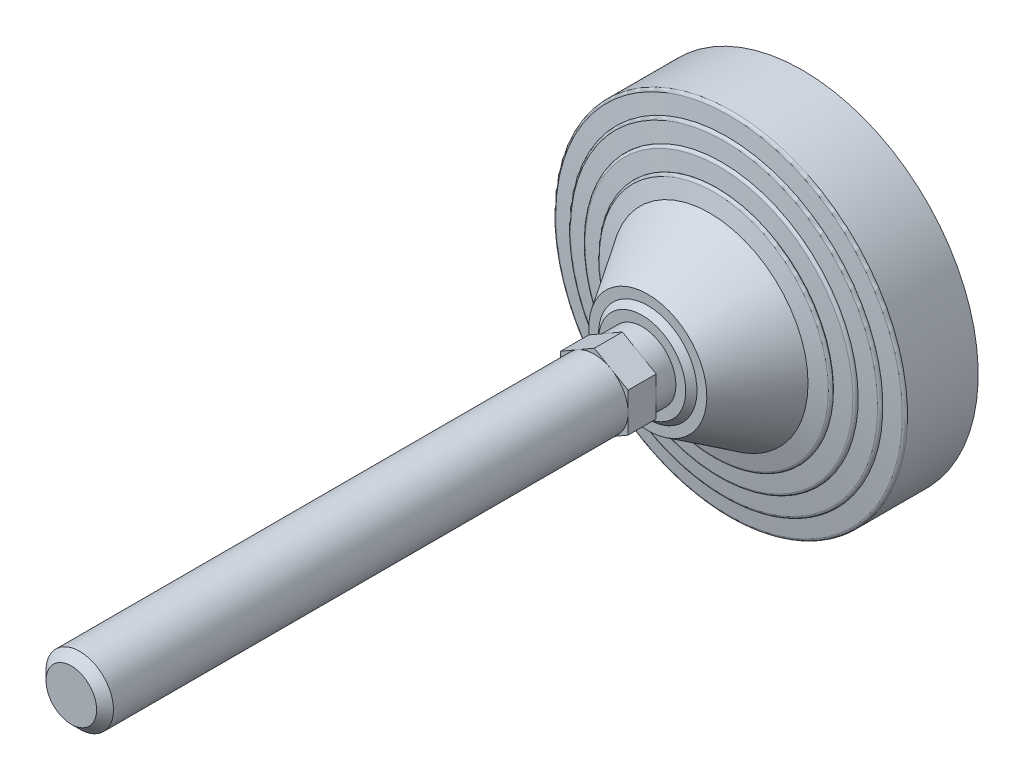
ISO-10303-21;
HEADER;
FILE_DESCRIPTION(('STEP AP214'),'2;1');
FILE_NAME('part.step','',(''),(''),'','','');
FILE_SCHEMA(('AUTOMOTIVE_DESIGN { 1 0 10303 214 1 1 1 1 }'));
ENDSEC;
DATA;
#1=APPLICATION_CONTEXT('core data for automotive mechanical design processes');
#2=APPLICATION_PROTOCOL_DEFINITION('international standard','automotive_design',2000,#1);
#3=PRODUCT_CONTEXT('',#1,'mechanical');
#4=PRODUCT('Part','Part','',(#3));
#5=PRODUCT_RELATED_PRODUCT_CATEGORY('part','',(#4));
#6=PRODUCT_DEFINITION_FORMATION('','',#4);
#7=PRODUCT_DEFINITION_CONTEXT('part definition',#1,'design');
#8=PRODUCT_DEFINITION('design','',#6,#7);
#9=PRODUCT_DEFINITION_SHAPE('','',#8);
#10=(LENGTH_UNIT() NAMED_UNIT(*) SI_UNIT(.MILLI.,.METRE.));
#11=(NAMED_UNIT(*) PLANE_ANGLE_UNIT() SI_UNIT($,.RADIAN.));
#12=(NAMED_UNIT(*) SI_UNIT($,.STERADIAN.) SOLID_ANGLE_UNIT());
#13=UNCERTAINTY_MEASURE_WITH_UNIT(LENGTH_MEASURE(1.E-05),#10,'distance_accuracy_value','');
#14=(GEOMETRIC_REPRESENTATION_CONTEXT(3) GLOBAL_UNCERTAINTY_ASSIGNED_CONTEXT((#13)) GLOBAL_UNIT_ASSIGNED_CONTEXT((#10,
#11,#12)) REPRESENTATION_CONTEXT('',''));
#15=CARTESIAN_POINT('',(0.,0.,0.));
#16=DIRECTION('',(0.,0.,1.));
#17=DIRECTION('',(1.,0.,0.));
#18=AXIS2_PLACEMENT_3D('',#15,#16,#17);
#19=CARTESIAN_POINT('',(0.,0.,0.));
#20=DIRECTION('',(0.,0.,1.));
#21=DIRECTION('',(0.,-1.,0.));
#22=AXIS2_PLACEMENT_3D('',#19,#20,#21);
#23=PLANE('',#22);
#24=CARTESIAN_POINT('',(0.,0.,0.));
#25=DIRECTION('',(0.,0.,-1.));
#26=DIRECTION('',(0.,1.,0.));
#27=AXIS2_PLACEMENT_3D('',#24,#25,#26);
#28=CIRCLE('',#27,62.5);
#29=CARTESIAN_POINT('',(0.,62.5,0.));
#30=VERTEX_POINT('',#29);
#31=EDGE_CURVE('E181',#30,#30,#28,.T.);
#32=ORIENTED_EDGE('',*,*,#31,.T.);
#33=EDGE_LOOP('',(#32));
#34=FACE_BOUND('',#33,.T.);
#35=ADVANCED_FACE('F14',(#34),#23,.F.);
#36=CARTESIAN_POINT('',(0.,0.,0.));
#37=DIRECTION('',(0.,0.,-1.));
#38=DIRECTION('',(0.,1.,0.));
#39=AXIS2_PLACEMENT_3D('',#36,#37,#38);
#40=CYLINDRICAL_SURFACE('',#39,11.9999999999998);
#41=CARTESIAN_POINT('',(0.,0.,64.0000000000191));
#42=DIRECTION('',(0.,0.,-1.));
#43=DIRECTION('',(0.,1.,0.));
#44=AXIS2_PLACEMENT_3D('',#41,#42,#43);
#45=CIRCLE('',#44,11.9999999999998);
#46=CARTESIAN_POINT('',(-6.,10.3923048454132,64.0000000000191));
#47=VERTEX_POINT('',#46);
#48=CARTESIAN_POINT('',(6.,10.3923048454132,64.0000000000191));
#49=VERTEX_POINT('',#48);
#50=EDGE_CURVE('E17',#47,#49,#45,.T.);
#51=ORIENTED_EDGE('',*,*,#50,.T.);
#52=CARTESIAN_POINT('',(12.,0.,64.0000000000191));
#53=VERTEX_POINT('',#52);
#54=EDGE_CURVE('E9',#49,#53,#45,.T.);
#55=ORIENTED_EDGE('',*,*,#54,.T.);
#56=CARTESIAN_POINT('',(6.,-10.3923048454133,64.0000000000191));
#57=VERTEX_POINT('',#56);
#58=EDGE_CURVE('E22',#53,#57,#45,.T.);
#59=ORIENTED_EDGE('',*,*,#58,.T.);
#60=CARTESIAN_POINT('',(-6.,-10.3923048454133,64.0000000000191));
#61=VERTEX_POINT('',#60);
#62=EDGE_CURVE('E247',#57,#61,#45,.T.);
#63=ORIENTED_EDGE('',*,*,#62,.T.);
#64=CARTESIAN_POINT('',(-12.,0.,64.0000000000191));
#65=VERTEX_POINT('',#64);
#66=EDGE_CURVE('E245',#61,#65,#45,.T.);
#67=ORIENTED_EDGE('',*,*,#66,.T.);
#68=EDGE_CURVE('E242',#65,#47,#45,.T.);
#69=ORIENTED_EDGE('',*,*,#68,.T.);
#70=EDGE_LOOP('',(#51,#55,#59,#63,#67,#69));
#71=FACE_BOUND('',#70,.T.);
#72=CARTESIAN_POINT('',(0.,0.,57.));
#73=DIRECTION('',(0.,0.,-1.));
#74=DIRECTION('',(0.,1.,0.));
#75=AXIS2_PLACEMENT_3D('',#72,#73,#74);
#76=CIRCLE('',#75,11.9999999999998);
#77=CARTESIAN_POINT('',(0.,11.9999999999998,57.));
#78=VERTEX_POINT('',#77);
#79=EDGE_CURVE('E229',#78,#78,#76,.T.);
#80=ORIENTED_EDGE('',*,*,#79,.F.);
#81=EDGE_LOOP('',(#80));
#82=FACE_BOUND('',#81,.T.);
#83=ADVANCED_FACE('F250',(#71,#82),#40,.T.);
#84=CARTESIAN_POINT('',(-11.9999999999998,0.,57.));
#85=DIRECTION('',(0.,0.,-1.));
#86=DIRECTION('',(0.,1.,0.));
#87=AXIS2_PLACEMENT_3D('',#84,#85,#86);
#88=PLANE('',#87);
#89=CARTESIAN_POINT('',(0.,0.,57.));
#90=DIRECTION('',(0.,0.,-1.));
#91=DIRECTION('',(0.,1.,0.));
#92=AXIS2_PLACEMENT_3D('',#89,#90,#91);
#93=CIRCLE('',#92,15.5);
#94=CARTESIAN_POINT('',(0.,15.5,57.));
#95=VERTEX_POINT('',#94);
#96=EDGE_CURVE('E226',#95,#95,#93,.T.);
#97=ORIENTED_EDGE('',*,*,#96,.F.);
#98=EDGE_LOOP('',(#97));
#99=FACE_BOUND('',#98,.T.);
#100=ORIENTED_EDGE('',*,*,#79,.T.);
#101=EDGE_LOOP('',(#100));
#102=FACE_BOUND('',#101,.T.);
#103=ADVANCED_FACE('F329',(#99,#102),#88,.F.);
#104=CARTESIAN_POINT('',(0.,0.,57.));
#105=DIRECTION('',(0.,0.,-1.));
#106=DIRECTION('',(0.,1.,0.));
#107=AXIS2_PLACEMENT_3D('',#104,#105,#106);
#108=CONICAL_SURFACE('',#107,15.5,0.785398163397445);
#109=CARTESIAN_POINT('',(0.,0.,55.));
#110=DIRECTION('',(0.,0.,-1.));
#111=DIRECTION('',(0.,1.,0.));
#112=AXIS2_PLACEMENT_3D('',#109,#110,#111);
#113=CIRCLE('',#112,17.5);
#114=CARTESIAN_POINT('',(0.,17.5,55.));
#115=VERTEX_POINT('',#114);
#116=EDGE_CURVE('E223',#115,#115,#113,.T.);
#117=ORIENTED_EDGE('',*,*,#116,.F.);
#118=EDGE_LOOP('',(#117));
#119=FACE_BOUND('',#118,.T.);
#120=ORIENTED_EDGE('',*,*,#96,.T.);
#121=EDGE_LOOP('',(#120));
#122=FACE_BOUND('',#121,.T.);
#123=ADVANCED_FACE('F414',(#119,#122),#108,.T.);
#124=CARTESIAN_POINT('',(-17.5,0.,55.));
#125=DIRECTION('',(0.,0.,-1.));
#126=DIRECTION('',(0.,1.,0.));
#127=AXIS2_PLACEMENT_3D('',#124,#125,#126);
#128=PLANE('',#127);
#129=CARTESIAN_POINT('',(0.,0.,55.));
#130=DIRECTION('',(0.,0.,-1.));
#131=DIRECTION('',(0.,1.,0.));
#132=AXIS2_PLACEMENT_3D('',#129,#130,#131);
#133=CIRCLE('',#132,20.9999999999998);
#134=CARTESIAN_POINT('',(0.,20.9999999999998,55.));
#135=VERTEX_POINT('',#134);
#136=EDGE_CURVE('E220',#135,#135,#133,.T.);
#137=ORIENTED_EDGE('',*,*,#136,.F.);
#138=EDGE_LOOP('',(#137));
#139=FACE_BOUND('',#138,.T.);
#140=ORIENTED_EDGE('',*,*,#116,.T.);
#141=EDGE_LOOP('',(#140));
#142=FACE_BOUND('',#141,.T.);
#143=ADVANCED_FACE('F408',(#139,#142),#128,.F.);
#144=CARTESIAN_POINT('',(0.,0.,55.));
#145=DIRECTION('',(0.,0.,-1.));
#146=DIRECTION('',(0.,1.,0.));
#147=AXIS2_PLACEMENT_3D('',#144,#145,#146);
#148=CONICAL_SURFACE('',#147,20.9999999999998,0.566729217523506);
#149=CARTESIAN_POINT('',(0.,0.,33.));
#150=DIRECTION('',(0.,0.,-1.));
#151=DIRECTION('',(0.,1.,0.));
#152=AXIS2_PLACEMENT_3D('',#149,#150,#151);
#153=CIRCLE('',#152,35.);
#154=CARTESIAN_POINT('',(0.,35.,33.));
#155=VERTEX_POINT('',#154);
#156=EDGE_CURVE('E217',#155,#155,#153,.T.);
#157=ORIENTED_EDGE('',*,*,#156,.F.);
#158=EDGE_LOOP('',(#157));
#159=FACE_BOUND('',#158,.T.);
#160=ORIENTED_EDGE('',*,*,#136,.T.);
#161=EDGE_LOOP('',(#160));
#162=FACE_BOUND('',#161,.T.);
#163=ADVANCED_FACE('F402',(#159,#162),#148,.T.);
#164=CARTESIAN_POINT('',(0.,0.,33.));
#165=DIRECTION('',(0.,0.,-1.));
#166=DIRECTION('',(0.,1.,0.));
#167=AXIS2_PLACEMENT_3D('',#164,#165,#166);
#168=CONICAL_SURFACE('',#167,35.,1.32154418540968);
#169=CARTESIAN_POINT('',(0.,0.,31.5372089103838));
#170=DIRECTION('',(0.,0.,-1.));
#171=DIRECTION('',(0.,1.,0.));
#172=AXIS2_PLACEMENT_3D('',#169,#170,#171);
#173=CIRCLE('',#172,40.7466792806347);
#174=CARTESIAN_POINT('',(0.,40.7466792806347,31.5372089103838));
#175=VERTEX_POINT('',#174);
#176=EDGE_CURVE('E214',#175,#175,#173,.T.);
#177=ORIENTED_EDGE('',*,*,#176,.F.);
#178=EDGE_LOOP('',(#177));
#179=FACE_BOUND('',#178,.T.);
#180=ORIENTED_EDGE('',*,*,#156,.T.);
#181=EDGE_LOOP('',(#180));
#182=FACE_BOUND('',#181,.T.);
#183=ADVANCED_FACE('F396',(#179,#182),#168,.T.);
#184=CARTESIAN_POINT('',(0.,0.,30.5681117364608));
#185=DIRECTION('',(0.,0.,-1.));
#186=DIRECTION('',(0.,1.,0.));
#187=AXIS2_PLACEMENT_3D('',#184,#185,#186);
#188=TOROIDAL_SURFACE('',#187,40.5,1.);
#189=CARTESIAN_POINT('',(0.,0.,30.5681117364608));
#190=DIRECTION('',(0.,0.,-1.));
#191=DIRECTION('',(0.,1.,0.));
#192=AXIS2_PLACEMENT_3D('',#189,#190,#191);
#193=CIRCLE('',#192,41.5);
#194=CARTESIAN_POINT('',(0.,41.5,30.5681117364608));
#195=VERTEX_POINT('',#194);
#196=EDGE_CURVE('E211',#195,#195,#193,.T.);
#197=ORIENTED_EDGE('',*,*,#196,.F.);
#198=EDGE_LOOP('',(#197));
#199=FACE_BOUND('',#198,.T.);
#200=ORIENTED_EDGE('',*,*,#176,.T.);
#201=EDGE_LOOP('',(#200));
#202=FACE_BOUND('',#201,.T.);
#203=ADVANCED_FACE('F390',(#199,#202),#188,.T.);
#204=CARTESIAN_POINT('',(0.,0.,0.));
#205=DIRECTION('',(0.,0.,-1.));
#206=DIRECTION('',(0.,1.,0.));
#207=AXIS2_PLACEMENT_3D('',#204,#205,#206);
#208=CYLINDRICAL_SURFACE('',#207,41.5);
#209=CARTESIAN_POINT('',(0.,0.,30.4545454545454));
#210=DIRECTION('',(0.,0.,-1.));
#211=DIRECTION('',(0.,1.,0.));
#212=AXIS2_PLACEMENT_3D('',#209,#210,#211);
#213=CIRCLE('',#212,41.5);
#214=CARTESIAN_POINT('',(0.,41.5,30.4545454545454));
#215=VERTEX_POINT('',#214);
#216=EDGE_CURVE('E208',#215,#215,#213,.T.);
#217=ORIENTED_EDGE('',*,*,#216,.F.);
#218=EDGE_LOOP('',(#217));
#219=FACE_BOUND('',#218,.T.);
#220=ORIENTED_EDGE('',*,*,#196,.T.);
#221=EDGE_LOOP('',(#220));
#222=FACE_BOUND('',#221,.T.);
#223=ADVANCED_FACE('F384',(#219,#222),#208,.T.);
#224=CARTESIAN_POINT('',(0.,0.,30.4545454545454));
#225=DIRECTION('',(0.,0.,-1.));
#226=DIRECTION('',(0.,1.,0.));
#227=AXIS2_PLACEMENT_3D('',#224,#225,#226);
#228=CONICAL_SURFACE('',#227,41.5,1.44420419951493);
#229=CARTESIAN_POINT('',(0.,0.,29.6748403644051));
#230=DIRECTION('',(0.,0.,-1.));
#231=DIRECTION('',(0.,1.,0.));
#232=AXIS2_PLACEMENT_3D('',#229,#230,#231);
#233=CIRCLE('',#232,47.6262542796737);
#234=CARTESIAN_POINT('',(0.,47.6262542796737,29.6748403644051));
#235=VERTEX_POINT('',#234);
#236=EDGE_CURVE('E205',#235,#235,#233,.T.);
#237=ORIENTED_EDGE('',*,*,#236,.F.);
#238=EDGE_LOOP('',(#237));
#239=FACE_BOUND('',#238,.T.);
#240=ORIENTED_EDGE('',*,*,#216,.T.);
#241=EDGE_LOOP('',(#240));
#242=FACE_BOUND('',#241,.T.);
#243=ADVANCED_FACE('F378',(#239,#242),#228,.T.);
#244=CARTESIAN_POINT('',(0.,0.,28.6828424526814));
#245=DIRECTION('',(0.,0.,-1.));
#246=DIRECTION('',(0.,1.,0.));
#247=AXIS2_PLACEMENT_3D('',#244,#245,#246);
#248=TOROIDAL_SURFACE('',#247,47.5,1.00000000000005);
#249=CARTESIAN_POINT('',(0.,0.,28.6828424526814));
#250=DIRECTION('',(0.,0.,-1.));
#251=DIRECTION('',(0.,1.,0.));
#252=AXIS2_PLACEMENT_3D('',#249,#250,#251);
#253=CIRCLE('',#252,48.5);
#254=CARTESIAN_POINT('',(0.,48.5,28.6828424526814));
#255=VERTEX_POINT('',#254);
#256=EDGE_CURVE('E202',#255,#255,#253,.T.);
#257=ORIENTED_EDGE('',*,*,#256,.F.);
#258=EDGE_LOOP('',(#257));
#259=FACE_BOUND('',#258,.T.);
#260=ORIENTED_EDGE('',*,*,#236,.T.);
#261=EDGE_LOOP('',(#260));
#262=FACE_BOUND('',#261,.T.);
#263=ADVANCED_FACE('F372',(#259,#262),#248,.T.);
#264=CARTESIAN_POINT('',(0.,0.,0.));
#265=DIRECTION('',(0.,0.,-1.));
#266=DIRECTION('',(0.,1.,0.));
#267=AXIS2_PLACEMENT_3D('',#264,#265,#266);
#268=CYLINDRICAL_SURFACE('',#267,48.5);
#269=CARTESIAN_POINT('',(0.,0.,28.6727272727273));
#270=DIRECTION('',(0.,0.,-1.));
#271=DIRECTION('',(0.,1.,0.));
#272=AXIS2_PLACEMENT_3D('',#269,#270,#271);
#273=CIRCLE('',#272,48.5);
#274=CARTESIAN_POINT('',(0.,48.5,28.6727272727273));
#275=VERTEX_POINT('',#274);
#276=EDGE_CURVE('E199',#275,#275,#273,.T.);
#277=ORIENTED_EDGE('',*,*,#276,.F.);
#278=EDGE_LOOP('',(#277));
#279=FACE_BOUND('',#278,.T.);
#280=ORIENTED_EDGE('',*,*,#256,.T.);
#281=EDGE_LOOP('',(#280));
#282=FACE_BOUND('',#281,.T.);
#283=ADVANCED_FACE('F366',(#279,#282),#268,.T.);
#284=CARTESIAN_POINT('',(0.,0.,28.6727272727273));
#285=DIRECTION('',(0.,0.,-1.));
#286=DIRECTION('',(0.,1.,0.));
#287=AXIS2_PLACEMENT_3D('',#284,#285,#286);
#288=CONICAL_SURFACE('',#287,48.5,1.44420419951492);
#289=CARTESIAN_POINT('',(0.,0.,27.8930221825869));
#290=DIRECTION('',(0.,0.,-1.));
#291=DIRECTION('',(0.,1.,0.));
#292=AXIS2_PLACEMENT_3D('',#289,#290,#291);
#293=CIRCLE('',#292,54.6262542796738);
#294=CARTESIAN_POINT('',(0.,54.6262542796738,27.8930221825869));
#295=VERTEX_POINT('',#294);
#296=EDGE_CURVE('E196',#295,#295,#293,.T.);
#297=ORIENTED_EDGE('',*,*,#296,.F.);
#298=EDGE_LOOP('',(#297));
#299=FACE_BOUND('',#298,.T.);
#300=ORIENTED_EDGE('',*,*,#276,.T.);
#301=EDGE_LOOP('',(#300));
#302=FACE_BOUND('',#301,.T.);
#303=ADVANCED_FACE('F360',(#299,#302),#288,.T.);
#304=CARTESIAN_POINT('',(0.,0.,26.9010242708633));
#305=DIRECTION('',(0.,0.,-1.));
#306=DIRECTION('',(0.,1.,0.));
#307=AXIS2_PLACEMENT_3D('',#304,#305,#306);
#308=TOROIDAL_SURFACE('',#307,54.5,1.);
#309=CARTESIAN_POINT('',(0.,0.,26.9010242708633));
#310=DIRECTION('',(0.,0.,-1.));
#311=DIRECTION('',(0.,1.,0.));
#312=AXIS2_PLACEMENT_3D('',#309,#310,#311);
#313=CIRCLE('',#312,55.5);
#314=CARTESIAN_POINT('',(0.,55.5,26.9010242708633));
#315=VERTEX_POINT('',#314);
#316=EDGE_CURVE('E193',#315,#315,#313,.T.);
#317=ORIENTED_EDGE('',*,*,#316,.F.);
#318=EDGE_LOOP('',(#317));
#319=FACE_BOUND('',#318,.T.);
#320=ORIENTED_EDGE('',*,*,#296,.T.);
#321=EDGE_LOOP('',(#320));
#322=FACE_BOUND('',#321,.T.);
#323=ADVANCED_FACE('F354',(#319,#322),#308,.T.);
#324=CARTESIAN_POINT('',(0.,0.,0.));
#325=DIRECTION('',(0.,0.,-1.));
#326=DIRECTION('',(0.,1.,0.));
#327=AXIS2_PLACEMENT_3D('',#324,#325,#326);
#328=CYLINDRICAL_SURFACE('',#327,55.5);
#329=CARTESIAN_POINT('',(0.,0.,26.8909090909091));
#330=DIRECTION('',(0.,0.,-1.));
#331=DIRECTION('',(0.,1.,0.));
#332=AXIS2_PLACEMENT_3D('',#329,#330,#331);
#333=CIRCLE('',#332,55.5);
#334=CARTESIAN_POINT('',(0.,55.5,26.8909090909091));
#335=VERTEX_POINT('',#334);
#336=EDGE_CURVE('E190',#335,#335,#333,.T.);
#337=ORIENTED_EDGE('',*,*,#336,.F.);
#338=EDGE_LOOP('',(#337));
#339=FACE_BOUND('',#338,.T.);
#340=ORIENTED_EDGE('',*,*,#316,.T.);
#341=EDGE_LOOP('',(#340));
#342=FACE_BOUND('',#341,.T.);
#343=ADVANCED_FACE('F348',(#339,#342),#328,.T.);
#344=CARTESIAN_POINT('',(0.,0.,26.8909090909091));
#345=DIRECTION('',(0.,0.,-1.));
#346=DIRECTION('',(0.,1.,0.));
#347=AXIS2_PLACEMENT_3D('',#344,#345,#346);
#348=CONICAL_SURFACE('',#347,55.5,1.44420419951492);
#349=CARTESIAN_POINT('',(0.,0.,26.1112040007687));
#350=DIRECTION('',(0.,0.,-1.));
#351=DIRECTION('',(0.,1.,0.));
#352=AXIS2_PLACEMENT_3D('',#349,#350,#351);
#353=CIRCLE('',#352,61.6262542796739);
#354=CARTESIAN_POINT('',(0.,61.6262542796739,26.1112040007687));
#355=VERTEX_POINT('',#354);
#356=EDGE_CURVE('E187',#355,#355,#353,.T.);
#357=ORIENTED_EDGE('',*,*,#356,.F.);
#358=EDGE_LOOP('',(#357));
#359=FACE_BOUND('',#358,.T.);
#360=ORIENTED_EDGE('',*,*,#336,.T.);
#361=EDGE_LOOP('',(#360));
#362=FACE_BOUND('',#361,.T.);
#363=ADVANCED_FACE('F342',(#359,#362),#348,.T.);
#364=CARTESIAN_POINT('',(0.,0.,25.1192060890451));
#365=DIRECTION('',(0.,0.,-1.));
#366=DIRECTION('',(0.,1.,0.));
#367=AXIS2_PLACEMENT_3D('',#364,#365,#366);
#368=TOROIDAL_SURFACE('',#367,61.5,1.);
#369=CARTESIAN_POINT('',(0.,0.,25.1192060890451));
#370=DIRECTION('',(0.,0.,-1.));
#371=DIRECTION('',(0.,1.,0.));
#372=AXIS2_PLACEMENT_3D('',#369,#370,#371);
#373=CIRCLE('',#372,62.5);
#374=CARTESIAN_POINT('',(0.,62.5,25.1192060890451));
#375=VERTEX_POINT('',#374);
#376=EDGE_CURVE('E184',#375,#375,#373,.T.);
#377=ORIENTED_EDGE('',*,*,#376,.F.);
#378=EDGE_LOOP('',(#377));
#379=FACE_BOUND('',#378,.T.);
#380=ORIENTED_EDGE('',*,*,#356,.T.);
#381=EDGE_LOOP('',(#380));
#382=FACE_BOUND('',#381,.T.);
#383=ADVANCED_FACE('F336',(#379,#382),#368,.T.);
#384=CARTESIAN_POINT('',(0.,0.,0.));
#385=DIRECTION('',(0.,0.,-1.));
#386=DIRECTION('',(0.,1.,0.));
#387=AXIS2_PLACEMENT_3D('',#384,#385,#386);
#388=CYLINDRICAL_SURFACE('',#387,62.5);
#389=ORIENTED_EDGE('',*,*,#31,.F.);
#390=EDGE_LOOP('',(#389));
#391=FACE_BOUND('',#390,.T.);
#392=ORIENTED_EDGE('',*,*,#376,.T.);
#393=EDGE_LOOP('',(#392));
#394=FACE_BOUND('',#393,.T.);
#395=ADVANCED_FACE('F333',(#391,#394),#388,.T.);
#396=CARTESIAN_POINT('',(-12.,-6.92820323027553,74.0000000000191));
#397=DIRECTION('',(0.,0.,-1.));
#398=DIRECTION('',(0.,1.,0.));
#399=AXIS2_PLACEMENT_3D('',#396,#397,#398);
#400=PLANE('',#399);
#401=DIRECTION('',(-0.866025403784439,0.5,0.));
#402=VECTOR('',#401,1.);
#403=CARTESIAN_POINT('',(12.,6.92820323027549,74.0000000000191));
#404=LINE('',#403,#402);
#405=CARTESIAN_POINT('',(12.,6.92820323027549,74.0000000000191));
#406=VERTEX_POINT('',#405);
#407=CARTESIAN_POINT('',(6.,10.3923048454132,74.0000000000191));
#408=VERTEX_POINT('',#407);
#409=EDGE_CURVE('E136',#406,#408,#404,.T.);
#410=ORIENTED_EDGE('',*,*,#409,.T.);
#411=CARTESIAN_POINT('',(0.,0.,74.0000000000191));
#412=DIRECTION('',(0.,0.,-1.));
#413=DIRECTION('',(0.,1.,0.));
#414=AXIS2_PLACEMENT_3D('',#411,#412,#413);
#415=CIRCLE('',#414,12.0000000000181);
#416=CARTESIAN_POINT('',(12.,0.,74.0000000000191));
#417=VERTEX_POINT('',#416);
#418=EDGE_CURVE('E232',#408,#417,#415,.T.);
#419=ORIENTED_EDGE('',*,*,#418,.T.);
#420=DIRECTION('',(0.,1.,0.));
#421=VECTOR('',#420,1.);
#422=CARTESIAN_POINT('',(12.,-6.92820323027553,74.0000000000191));
#423=LINE('',#422,#421);
#424=EDGE_CURVE('E129',#417,#406,#423,.T.);
#425=ORIENTED_EDGE('',*,*,#424,.T.);
#426=EDGE_LOOP('',(#410,#419,#425));
#427=FACE_BOUND('',#426,.T.);
#428=ADVANCED_FACE('F306',(#427),#400,.F.);
#429=CARTESIAN_POINT('',(12.,-6.92820323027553,74.0000000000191));
#430=VERTEX_POINT('',#429);
#431=EDGE_CURVE('E131',#430,#417,#423,.T.);
#432=ORIENTED_EDGE('',*,*,#431,.T.);
#433=CARTESIAN_POINT('',(0.,0.,74.0000000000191));
#434=DIRECTION('',(0.,0.,-1.));
#435=DIRECTION('',(0.,1.,0.));
#436=AXIS2_PLACEMENT_3D('',#433,#434,#435);
#437=CIRCLE('',#436,12.0000000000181);
#438=CARTESIAN_POINT('',(6.,-10.3923048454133,74.0000000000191));
#439=VERTEX_POINT('',#438);
#440=EDGE_CURVE('E180',#417,#439,#437,.T.);
#441=ORIENTED_EDGE('',*,*,#440,.T.);
#442=DIRECTION('',(0.866025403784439,0.5,0.));
#443=VECTOR('',#442,1.);
#444=CARTESIAN_POINT('',(0.,-13.856406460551,74.0000000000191));
#445=LINE('',#444,#443);
#446=EDGE_CURVE('E128',#439,#430,#445,.T.);
#447=ORIENTED_EDGE('',*,*,#446,.T.);
#448=EDGE_LOOP('',(#432,#441,#447));
#449=FACE_BOUND('',#448,.T.);
#450=ADVANCED_FACE('F297',(#449),#400,.F.);
#451=CARTESIAN_POINT('',(0.,-13.856406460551,74.0000000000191));
#452=VERTEX_POINT('',#451);
#453=EDGE_CURVE('E106',#452,#439,#445,.T.);
#454=ORIENTED_EDGE('',*,*,#453,.T.);
#455=CARTESIAN_POINT('',(-6.,-10.3923048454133,74.0000000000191));
#456=VERTEX_POINT('',#455);
#457=EDGE_CURVE('E107',#439,#456,#437,.T.);
#458=ORIENTED_EDGE('',*,*,#457,.T.);
#459=DIRECTION('',(0.866025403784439,-0.5,0.));
#460=VECTOR('',#459,1.);
#461=CARTESIAN_POINT('',(-12.,-6.92820323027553,74.0000000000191));
#462=LINE('',#461,#460);
#463=EDGE_CURVE('E102',#456,#452,#462,.T.);
#464=ORIENTED_EDGE('',*,*,#463,.T.);
#465=EDGE_LOOP('',(#454,#458,#464));
#466=FACE_BOUND('',#465,.T.);
#467=ADVANCED_FACE('F104',(#466),#400,.F.);
#468=CARTESIAN_POINT('',(-12.,-6.92820323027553,74.0000000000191));
#469=VERTEX_POINT('',#468);
#470=EDGE_CURVE('E111',#469,#456,#462,.T.);
#471=ORIENTED_EDGE('',*,*,#470,.T.);
#472=CARTESIAN_POINT('',(-12.,0.,74.0000000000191));
#473=VERTEX_POINT('',#472);
#474=EDGE_CURVE('E298',#456,#473,#437,.T.);
#475=ORIENTED_EDGE('',*,*,#474,.T.);
#476=DIRECTION('',(0.,-1.,0.));
#477=VECTOR('',#476,1.);
#478=CARTESIAN_POINT('',(-12.,6.92820323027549,74.0000000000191));
#479=LINE('',#478,#477);
#480=EDGE_CURVE('E143',#473,#469,#479,.T.);
#481=ORIENTED_EDGE('',*,*,#480,.T.);
#482=EDGE_LOOP('',(#471,#475,#481));
#483=FACE_BOUND('',#482,.T.);
#484=ADVANCED_FACE('F455',(#483),#400,.F.);
#485=CARTESIAN_POINT('',(-12.,6.92820323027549,74.0000000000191));
#486=VERTEX_POINT('',#485);
#487=EDGE_CURVE('E144',#486,#473,#479,.T.);
#488=ORIENTED_EDGE('',*,*,#487,.T.);
#489=CARTESIAN_POINT('',(-6.,10.3923048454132,74.0000000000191));
#490=VERTEX_POINT('',#489);
#491=EDGE_CURVE('E33',#473,#490,#437,.T.);
#492=ORIENTED_EDGE('',*,*,#491,.T.);
#493=DIRECTION('',(-0.866025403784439,-0.5,0.));
#494=VECTOR('',#493,1.);
#495=CARTESIAN_POINT('',(0.,13.856406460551,74.0000000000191));
#496=LINE('',#495,#494);
#497=EDGE_CURVE('E139',#490,#486,#496,.T.);
#498=ORIENTED_EDGE('',*,*,#497,.T.);
#499=EDGE_LOOP('',(#488,#492,#498));
#500=FACE_BOUND('',#499,.T.);
#501=ADVANCED_FACE('F303',(#500),#400,.F.);
#502=CARTESIAN_POINT('',(0.,13.856406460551,74.0000000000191));
#503=VERTEX_POINT('',#502);
#504=EDGE_CURVE('E140',#503,#490,#496,.T.);
#505=ORIENTED_EDGE('',*,*,#504,.T.);
#506=EDGE_CURVE('E29',#490,#408,#437,.T.);
#507=ORIENTED_EDGE('',*,*,#506,.T.);
#508=EDGE_CURVE('E135',#408,#503,#404,.T.);
#509=ORIENTED_EDGE('',*,*,#508,.T.);
#510=EDGE_LOOP('',(#505,#507,#509));
#511=FACE_BOUND('',#510,.T.);
#512=ADVANCED_FACE('F305',(#511),#400,.F.);
#513=CARTESIAN_POINT('',(-12.,-6.92820323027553,64.0000000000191));
#514=DIRECTION('',(0.,0.,-1.));
#515=DIRECTION('',(0.,1.,0.));
#516=AXIS2_PLACEMENT_3D('',#513,#514,#515);
#517=PLANE('',#516);
#518=ORIENTED_EDGE('',*,*,#54,.F.);
#519=DIRECTION('',(-0.866025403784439,0.5,0.));
#520=VECTOR('',#519,1.);
#521=CARTESIAN_POINT('',(12.,6.92820323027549,64.0000000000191));
#522=LINE('',#521,#520);
#523=CARTESIAN_POINT('',(12.,6.92820323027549,64.0000000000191));
#524=VERTEX_POINT('',#523);
#525=EDGE_CURVE('E157',#524,#49,#522,.T.);
#526=ORIENTED_EDGE('',*,*,#525,.F.);
#527=DIRECTION('',(0.,1.,0.));
#528=VECTOR('',#527,1.);
#529=CARTESIAN_POINT('',(12.,-6.92820323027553,64.0000000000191));
#530=LINE('',#529,#528);
#531=EDGE_CURVE('E152',#53,#524,#530,.T.);
#532=ORIENTED_EDGE('',*,*,#531,.F.);
#533=EDGE_LOOP('',(#518,#526,#532));
#534=FACE_BOUND('',#533,.T.);
#535=ADVANCED_FACE('F260',(#534),#517,.T.);
#536=ORIENTED_EDGE('',*,*,#58,.F.);
#537=CARTESIAN_POINT('',(12.,-6.92820323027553,64.0000000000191));
#538=VERTEX_POINT('',#537);
#539=EDGE_CURVE('E153',#538,#53,#530,.T.);
#540=ORIENTED_EDGE('',*,*,#539,.F.);
#541=DIRECTION('',(0.866025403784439,0.5,0.));
#542=VECTOR('',#541,1.);
#543=CARTESIAN_POINT('',(0.,-13.856406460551,64.0000000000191));
#544=LINE('',#543,#542);
#545=EDGE_CURVE('E149',#57,#538,#544,.T.);
#546=ORIENTED_EDGE('',*,*,#545,.F.);
#547=EDGE_LOOP('',(#536,#540,#546));
#548=FACE_BOUND('',#547,.T.);
#549=ADVANCED_FACE('F257',(#548),#517,.T.);
#550=ORIENTED_EDGE('',*,*,#62,.F.);
#551=CARTESIAN_POINT('',(0.,-13.856406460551,64.0000000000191));
#552=VERTEX_POINT('',#551);
#553=EDGE_CURVE('E150',#552,#57,#544,.T.);
#554=ORIENTED_EDGE('',*,*,#553,.F.);
#555=DIRECTION('',(0.866025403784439,-0.5,0.));
#556=VECTOR('',#555,1.);
#557=CARTESIAN_POINT('',(-12.,-6.92820323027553,64.0000000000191));
#558=LINE('',#557,#556);
#559=EDGE_CURVE('E118',#61,#552,#558,.T.);
#560=ORIENTED_EDGE('',*,*,#559,.F.);
#561=EDGE_LOOP('',(#550,#554,#560));
#562=FACE_BOUND('',#561,.T.);
#563=ADVANCED_FACE('F268',(#562),#517,.T.);
#564=ORIENTED_EDGE('',*,*,#66,.F.);
#565=CARTESIAN_POINT('',(-12.,-6.92820323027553,64.0000000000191));
#566=VERTEX_POINT('',#565);
#567=EDGE_CURVE('E147',#566,#61,#558,.T.);
#568=ORIENTED_EDGE('',*,*,#567,.F.);
#569=DIRECTION('',(0.,-1.,0.));
#570=VECTOR('',#569,1.);
#571=CARTESIAN_POINT('',(-12.,6.92820323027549,64.0000000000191));
#572=LINE('',#571,#570);
#573=EDGE_CURVE('E163',#65,#566,#572,.T.);
#574=ORIENTED_EDGE('',*,*,#573,.F.);
#575=EDGE_LOOP('',(#564,#568,#574));
#576=FACE_BOUND('',#575,.T.);
#577=ADVANCED_FACE('F273',(#576),#517,.T.);
#578=ORIENTED_EDGE('',*,*,#68,.F.);
#579=CARTESIAN_POINT('',(-12.,6.92820323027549,64.0000000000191));
#580=VERTEX_POINT('',#579);
#581=EDGE_CURVE('E123',#580,#65,#572,.T.);
#582=ORIENTED_EDGE('',*,*,#581,.F.);
#583=DIRECTION('',(-0.866025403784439,-0.5,0.));
#584=VECTOR('',#583,1.);
#585=CARTESIAN_POINT('',(0.,13.856406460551,64.0000000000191));
#586=LINE('',#585,#584);
#587=EDGE_CURVE('E159',#47,#580,#586,.T.);
#588=ORIENTED_EDGE('',*,*,#587,.F.);
#589=EDGE_LOOP('',(#578,#582,#588));
#590=FACE_BOUND('',#589,.T.);
#591=ADVANCED_FACE('F281',(#590),#517,.T.);
#592=ORIENTED_EDGE('',*,*,#50,.F.);
#593=CARTESIAN_POINT('',(0.,13.856406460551,64.0000000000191));
#594=VERTEX_POINT('',#593);
#595=EDGE_CURVE('E160',#594,#47,#586,.T.);
#596=ORIENTED_EDGE('',*,*,#595,.F.);
#597=EDGE_CURVE('E156',#49,#594,#522,.T.);
#598=ORIENTED_EDGE('',*,*,#597,.F.);
#599=EDGE_LOOP('',(#592,#596,#598));
#600=FACE_BOUND('',#599,.T.);
#601=ADVANCED_FACE('F289',(#600),#517,.T.);
#602=CARTESIAN_POINT('',(-12.,-6.92820323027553,64.0000000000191));
#603=DIRECTION('',(-0.5,-0.866025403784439,0.));
#604=DIRECTION('',(0.866025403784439,-0.5,0.));
#605=AXIS2_PLACEMENT_3D('',#602,#603,#604);
#606=PLANE('',#605);
#607=ORIENTED_EDGE('',*,*,#567,.T.);
#608=ORIENTED_EDGE('',*,*,#559,.T.);
#609=DIRECTION('',(0.,0.,1.));
#610=VECTOR('',#609,1.);
#611=CARTESIAN_POINT('',(0.,-13.856406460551,64.0000000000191));
#612=LINE('',#611,#610);
#613=EDGE_CURVE('E114',#552,#452,#612,.T.);
#614=ORIENTED_EDGE('',*,*,#613,.T.);
#615=ORIENTED_EDGE('',*,*,#463,.F.);
#616=ORIENTED_EDGE('',*,*,#470,.F.);
#617=DIRECTION('',(0.,0.,1.));
#618=VECTOR('',#617,1.);
#619=CARTESIAN_POINT('',(-12.,-6.92820323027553,64.0000000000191));
#620=LINE('',#619,#618);
#621=EDGE_CURVE('E166',#566,#469,#620,.T.);
#622=ORIENTED_EDGE('',*,*,#621,.F.);
#623=EDGE_LOOP('',(#607,#608,#614,#615,#616,#622));
#624=FACE_BOUND('',#623,.T.);
#625=ADVANCED_FACE('F116',(#624),#606,.T.);
#626=CARTESIAN_POINT('',(-12.,6.92820323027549,64.0000000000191));
#627=DIRECTION('',(-1.,0.,0.));
#628=DIRECTION('',(0.,-1.,0.));
#629=AXIS2_PLACEMENT_3D('',#626,#627,#628);
#630=PLANE('',#629);
#631=ORIENTED_EDGE('',*,*,#581,.T.);
#632=ORIENTED_EDGE('',*,*,#573,.T.);
#633=ORIENTED_EDGE('',*,*,#621,.T.);
#634=ORIENTED_EDGE('',*,*,#480,.F.);
#635=ORIENTED_EDGE('',*,*,#487,.F.);
#636=DIRECTION('',(0.,0.,1.));
#637=VECTOR('',#636,1.);
#638=CARTESIAN_POINT('',(-12.,6.92820323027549,64.0000000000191));
#639=LINE('',#638,#637);
#640=EDGE_CURVE('E169',#580,#486,#639,.T.);
#641=ORIENTED_EDGE('',*,*,#640,.F.);
#642=EDGE_LOOP('',(#631,#632,#633,#634,#635,#641));
#643=FACE_BOUND('',#642,.T.);
#644=ADVANCED_FACE('F277',(#643),#630,.T.);
#645=CARTESIAN_POINT('',(0.,13.856406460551,64.0000000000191));
#646=DIRECTION('',(-0.5,0.866025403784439,0.));
#647=DIRECTION('',(-0.866025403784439,-0.5,0.));
#648=AXIS2_PLACEMENT_3D('',#645,#646,#647);
#649=PLANE('',#648);
#650=ORIENTED_EDGE('',*,*,#595,.T.);
#651=ORIENTED_EDGE('',*,*,#587,.T.);
#652=ORIENTED_EDGE('',*,*,#640,.T.);
#653=ORIENTED_EDGE('',*,*,#497,.F.);
#654=ORIENTED_EDGE('',*,*,#504,.F.);
#655=DIRECTION('',(0.,0.,1.));
#656=VECTOR('',#655,1.);
#657=CARTESIAN_POINT('',(0.,13.856406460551,64.0000000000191));
#658=LINE('',#657,#656);
#659=EDGE_CURVE('E172',#594,#503,#658,.T.);
#660=ORIENTED_EDGE('',*,*,#659,.F.);
#661=EDGE_LOOP('',(#650,#651,#652,#653,#654,#660));
#662=FACE_BOUND('',#661,.T.);
#663=ADVANCED_FACE('F285',(#662),#649,.T.);
#664=CARTESIAN_POINT('',(12.,6.92820323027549,64.0000000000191));
#665=DIRECTION('',(0.5,0.866025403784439,0.));
#666=DIRECTION('',(-0.866025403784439,0.5,0.));
#667=AXIS2_PLACEMENT_3D('',#664,#665,#666);
#668=PLANE('',#667);
#669=ORIENTED_EDGE('',*,*,#525,.T.);
#670=ORIENTED_EDGE('',*,*,#597,.T.);
#671=ORIENTED_EDGE('',*,*,#659,.T.);
#672=ORIENTED_EDGE('',*,*,#508,.F.);
#673=ORIENTED_EDGE('',*,*,#409,.F.);
#674=DIRECTION('',(0.,0.,1.));
#675=VECTOR('',#674,1.);
#676=CARTESIAN_POINT('',(12.,6.92820323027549,64.0000000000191));
#677=LINE('',#676,#675);
#678=EDGE_CURVE('E175',#524,#406,#677,.T.);
#679=ORIENTED_EDGE('',*,*,#678,.F.);
#680=EDGE_LOOP('',(#669,#670,#671,#672,#673,#679));
#681=FACE_BOUND('',#680,.T.);
#682=ADVANCED_FACE('F291',(#681),#668,.T.);
#683=CARTESIAN_POINT('',(12.,-6.92820323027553,64.0000000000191));
#684=DIRECTION('',(1.,0.,0.));
#685=DIRECTION('',(0.,1.,0.));
#686=AXIS2_PLACEMENT_3D('',#683,#684,#685);
#687=PLANE('',#686);
#688=ORIENTED_EDGE('',*,*,#539,.T.);
#689=ORIENTED_EDGE('',*,*,#531,.T.);
#690=ORIENTED_EDGE('',*,*,#678,.T.);
#691=ORIENTED_EDGE('',*,*,#424,.F.);
#692=ORIENTED_EDGE('',*,*,#431,.F.);
#693=DIRECTION('',(0.,0.,1.));
#694=VECTOR('',#693,1.);
#695=CARTESIAN_POINT('',(12.,-6.92820323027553,64.0000000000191));
#696=LINE('',#695,#694);
#697=EDGE_CURVE('E122',#538,#430,#696,.T.);
#698=ORIENTED_EDGE('',*,*,#697,.F.);
#699=EDGE_LOOP('',(#688,#689,#690,#691,#692,#698));
#700=FACE_BOUND('',#699,.T.);
#701=ADVANCED_FACE('F264',(#700),#687,.T.);
#702=CARTESIAN_POINT('',(0.,-13.856406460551,64.0000000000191));
#703=DIRECTION('',(0.5,-0.866025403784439,0.));
#704=DIRECTION('',(0.866025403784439,0.5,0.));
#705=AXIS2_PLACEMENT_3D('',#702,#703,#704);
#706=PLANE('',#705);
#707=ORIENTED_EDGE('',*,*,#553,.T.);
#708=ORIENTED_EDGE('',*,*,#545,.T.);
#709=ORIENTED_EDGE('',*,*,#697,.T.);
#710=ORIENTED_EDGE('',*,*,#446,.F.);
#711=ORIENTED_EDGE('',*,*,#453,.F.);
#712=ORIENTED_EDGE('',*,*,#613,.F.);
#713=EDGE_LOOP('',(#707,#708,#709,#710,#711,#712));
#714=FACE_BOUND('',#713,.T.);
#715=ADVANCED_FACE('F126',(#714),#706,.T.);
#716=CARTESIAN_POINT('',(-9.00000000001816,0.,260.000000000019));
#717=DIRECTION('',(0.,0.,-1.));
#718=DIRECTION('',(0.,1.,0.));
#719=AXIS2_PLACEMENT_3D('',#716,#717,#718);
#720=PLANE('',#719);
#721=CARTESIAN_POINT('',(0.,0.,260.000000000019));
#722=DIRECTION('',(0.,0.,-1.));
#723=DIRECTION('',(0.,1.,0.));
#724=AXIS2_PLACEMENT_3D('',#721,#722,#723);
#725=CIRCLE('',#724,9.00000000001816);
#726=CARTESIAN_POINT('',(0.,9.00000000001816,260.000000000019));
#727=VERTEX_POINT('',#726);
#728=EDGE_CURVE('E237',#727,#727,#725,.T.);
#729=ORIENTED_EDGE('',*,*,#728,.F.);
#730=EDGE_LOOP('',(#729));
#731=FACE_BOUND('',#730,.T.);
#732=ADVANCED_FACE('F315',(#731),#720,.F.);
#733=CARTESIAN_POINT('',(0.,0.,260.000000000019));
#734=DIRECTION('',(0.,0.,-1.));
#735=DIRECTION('',(0.,1.,0.));
#736=AXIS2_PLACEMENT_3D('',#733,#734,#735);
#737=CONICAL_SURFACE('',#736,9.00000000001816,0.785398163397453);
#738=CARTESIAN_POINT('',(0.,0.,257.000000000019));
#739=DIRECTION('',(0.,0.,-1.));
#740=DIRECTION('',(0.,1.,0.));
#741=AXIS2_PLACEMENT_3D('',#738,#739,#740);
#742=CIRCLE('',#741,12.0000000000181);
#743=CARTESIAN_POINT('',(0.,12.0000000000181,257.000000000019));
#744=VERTEX_POINT('',#743);
#745=EDGE_CURVE('E235',#744,#744,#742,.T.);
#746=ORIENTED_EDGE('',*,*,#745,.F.);
#747=EDGE_LOOP('',(#746));
#748=FACE_BOUND('',#747,.T.);
#749=ORIENTED_EDGE('',*,*,#728,.T.);
#750=EDGE_LOOP('',(#749));
#751=FACE_BOUND('',#750,.T.);
#752=ADVANCED_FACE('F310',(#748,#751),#737,.T.);
#753=CARTESIAN_POINT('',(0.,0.,0.));
#754=DIRECTION('',(0.,0.,-1.));
#755=DIRECTION('',(0.,1.,0.));
#756=AXIS2_PLACEMENT_3D('',#753,#754,#755);
#757=CYLINDRICAL_SURFACE('',#756,12.0000000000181);
#758=ORIENTED_EDGE('',*,*,#418,.F.);
#759=ORIENTED_EDGE('',*,*,#506,.F.);
#760=ORIENTED_EDGE('',*,*,#491,.F.);
#761=ORIENTED_EDGE('',*,*,#474,.F.);
#762=ORIENTED_EDGE('',*,*,#457,.F.);
#763=ORIENTED_EDGE('',*,*,#440,.F.);
#764=EDGE_LOOP('',(#758,#759,#760,#761,#762,#763));
#765=FACE_BOUND('',#764,.T.);
#766=ORIENTED_EDGE('',*,*,#745,.T.);
#767=EDGE_LOOP('',(#766));
#768=FACE_BOUND('',#767,.T.);
#769=ADVANCED_FACE('F307',(#765,#768),#757,.T.);
#770=CLOSED_SHELL('',(#35,#83,#103,#123,#143,#163,#183,#203,#223,#243,#263,#283,#303,#323,#343,
#363,#383,#395,#428,#450,#467,#484,#501,#512,#535,#549,#563,#577,#591,#601,#625,#644,#663,#682,
#701,#715,#732,#752,#769));
#771=MANIFOLD_SOLID_BREP('B1',#770);
#772=ADVANCED_BREP_SHAPE_REPRESENTATION('',(#18,#771),#14);
#773=SHAPE_DEFINITION_REPRESENTATION(#9,#772);
ENDSEC;
END-ISO-10303-21;
